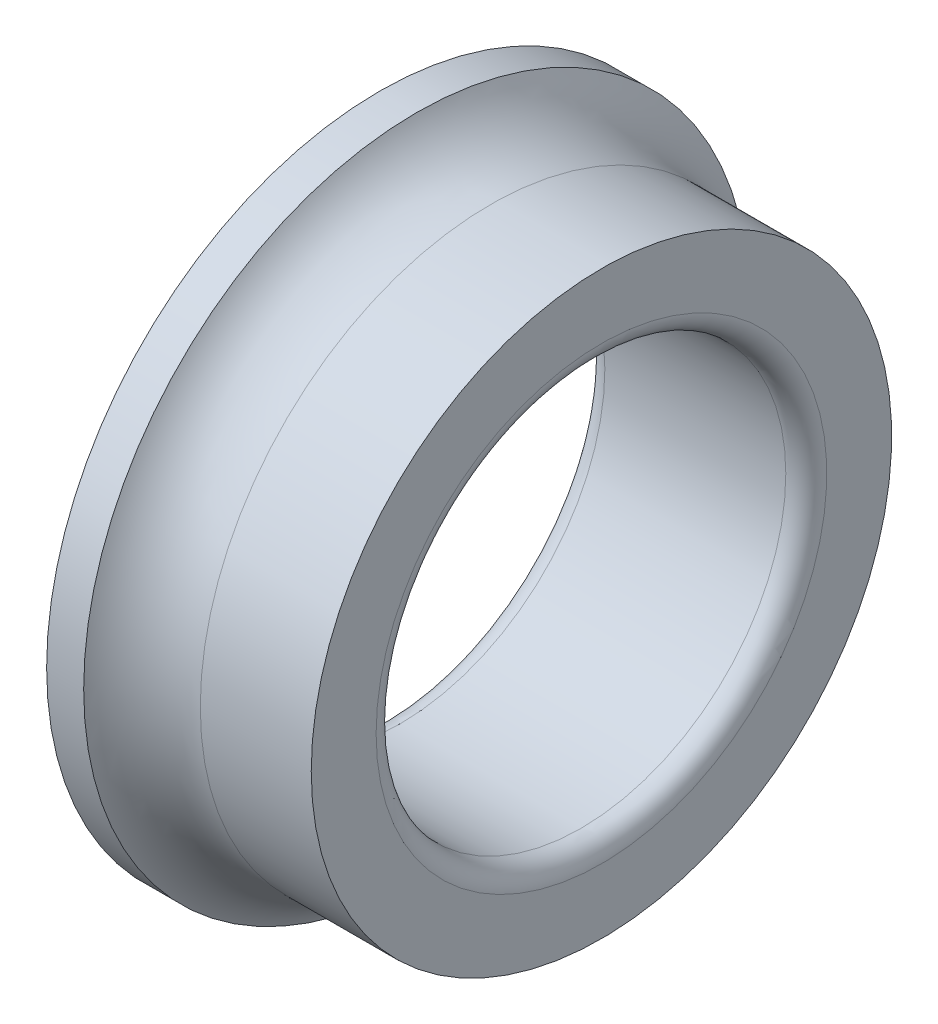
from build123d import *


with BuildPart() as part:
    # Esquisse1 → Base-R_volution (revolve)
    with BuildSketch(Plane(origin=(0, 0, 0), x_dir=(1, 0, 0), z_dir=(0, 1, 0)), mode=Mode.PRIVATE) as base_r_volution_sk:
        with BuildLine():
            Line((2.35, 6), (7.65, 6))
            ThreePointArc((7.65, 6), (8.074264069, 6.175735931), (8.25, 6.6))
            Line((8.25, 6.6), (8.25, 8.5))
            Line((8.25, 8.5), (5, 8.5))
            ThreePointArc((5, 8.5), (3.75, 8.834936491), (2.834936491, 9.75))
            Line((2.834936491, 9.75), (1.75, 9.75))
            Line((1.75, 9.75), (1.75, 6.6))
            ThreePointArc((1.75, 6.6), (1.925735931, 6.175735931), (2.35, 6))
        make_face()
    revolve(base_r_volution_sk.sketch.rotate(Axis((0, 0, 0), (1, 0, 0)), 180), axis=Axis((0, 0, 0), (1, 0, 0)))


solid = part.part
